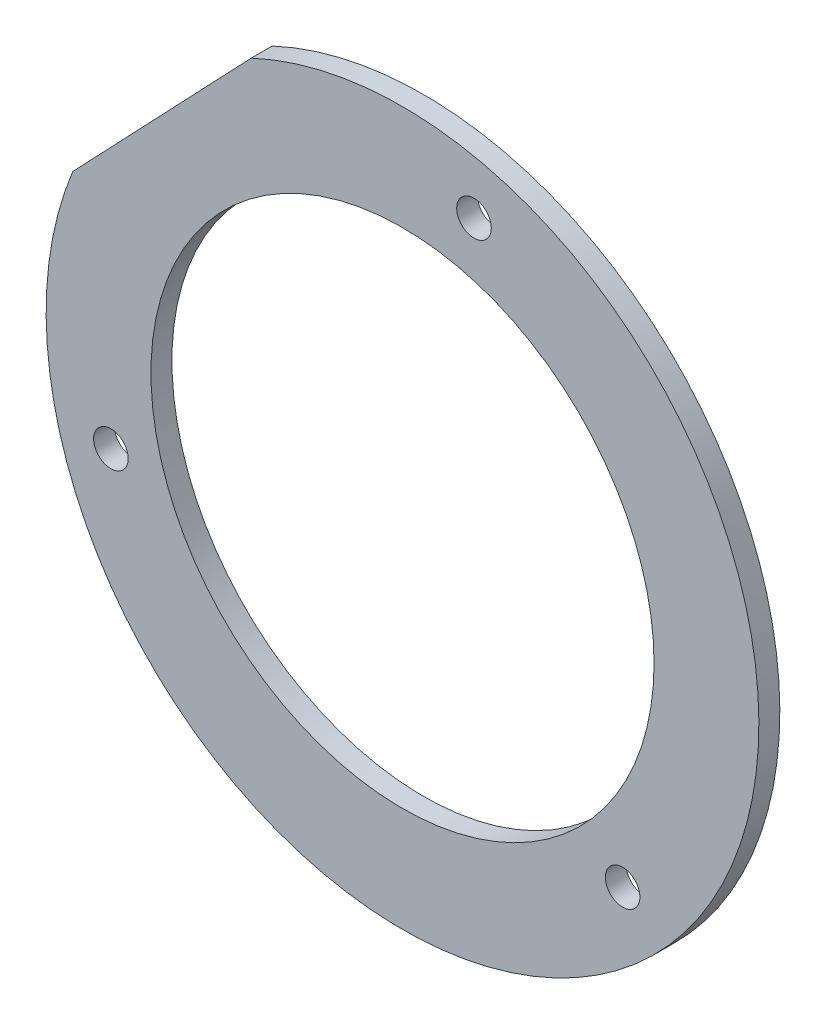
ISO-10303-21;
HEADER;
FILE_DESCRIPTION(('STEP AP214'),'2;1');
FILE_NAME('part.step','',(''),(''),'','','');
FILE_SCHEMA(('AUTOMOTIVE_DESIGN { 1 0 10303 214 1 1 1 1 }'));
ENDSEC;
DATA;
#1=APPLICATION_CONTEXT('core data for automotive mechanical design processes');
#2=APPLICATION_PROTOCOL_DEFINITION('international standard','automotive_design',2000,#1);
#3=PRODUCT_CONTEXT('',#1,'mechanical');
#4=PRODUCT('Part','Part','',(#3));
#5=PRODUCT_RELATED_PRODUCT_CATEGORY('part','',(#4));
#6=PRODUCT_DEFINITION_FORMATION('','',#4);
#7=PRODUCT_DEFINITION_CONTEXT('part definition',#1,'design');
#8=PRODUCT_DEFINITION('design','',#6,#7);
#9=PRODUCT_DEFINITION_SHAPE('','',#8);
#10=(LENGTH_UNIT() NAMED_UNIT(*) SI_UNIT(.MILLI.,.METRE.));
#11=(NAMED_UNIT(*) PLANE_ANGLE_UNIT() SI_UNIT($,.RADIAN.));
#12=(NAMED_UNIT(*) SI_UNIT($,.STERADIAN.) SOLID_ANGLE_UNIT());
#13=UNCERTAINTY_MEASURE_WITH_UNIT(LENGTH_MEASURE(1.E-05),#10,'distance_accuracy_value','');
#14=(GEOMETRIC_REPRESENTATION_CONTEXT(3) GLOBAL_UNCERTAINTY_ASSIGNED_CONTEXT((#13)) GLOBAL_UNIT_ASSIGNED_CONTEXT((#10,
#11,#12)) REPRESENTATION_CONTEXT('',''));
#15=CARTESIAN_POINT('',(0.,0.,0.));
#16=DIRECTION('',(0.,0.,1.));
#17=DIRECTION('',(1.,0.,0.));
#18=AXIS2_PLACEMENT_3D('',#15,#16,#17);
#19=CARTESIAN_POINT('',(17.,52.,2.));
#20=DIRECTION('',(0.,0.,1.));
#21=DIRECTION('',(1.,0.,0.));
#22=AXIS2_PLACEMENT_3D('',#19,#20,#21);
#23=PLANE('',#22);
#24=CARTESIAN_POINT('',(23.820508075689,80.1865334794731,2.));
#25=DIRECTION('',(0.,0.,1.));
#26=DIRECTION('',(1.,0.,0.));
#27=AXIS2_PLACEMENT_3D('',#24,#25,#26);
#28=CIRCLE('',#27,1.64999999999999);
#29=CARTESIAN_POINT('',(25.470508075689,80.1865334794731,2.));
#30=VERTEX_POINT('',#29);
#31=EDGE_CURVE('E93',#30,#30,#28,.T.);
#32=ORIENTED_EDGE('',*,*,#31,.F.);
#33=EDGE_LOOP('',(#32));
#34=FACE_BOUND('',#33,.T.);
#35=CARTESIAN_POINT('',(-10.8205080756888,43.8134665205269,2.));
#36=DIRECTION('',(0.,0.,1.));
#37=DIRECTION('',(1.,0.,0.));
#38=AXIS2_PLACEMENT_3D('',#35,#36,#37);
#39=CIRCLE('',#38,1.64999999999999);
#40=CARTESIAN_POINT('',(-9.17050807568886,43.8134665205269,2.));
#41=VERTEX_POINT('',#40);
#42=EDGE_CURVE('E87',#41,#41,#39,.T.);
#43=ORIENTED_EDGE('',*,*,#42,.F.);
#44=EDGE_LOOP('',(#43));
#45=FACE_BOUND('',#44,.T.);
#46=CARTESIAN_POINT('',(38.,32.,2.));
#47=DIRECTION('',(0.,0.,1.));
#48=DIRECTION('',(1.,0.,0.));
#49=AXIS2_PLACEMENT_3D('',#46,#47,#48);
#50=CIRCLE('',#49,1.64999999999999);
#51=CARTESIAN_POINT('',(39.65,32.,2.));
#52=VERTEX_POINT('',#51);
#53=EDGE_CURVE('E81',#52,#52,#50,.T.);
#54=ORIENTED_EDGE('',*,*,#53,.F.);
#55=EDGE_LOOP('',(#54));
#56=FACE_BOUND('',#55,.T.);
#57=CARTESIAN_POINT('',(17.,52.,2.));
#58=DIRECTION('',(0.,0.,1.));
#59=DIRECTION('',(1.,0.,0.));
#60=AXIS2_PLACEMENT_3D('',#57,#58,#59);
#61=CIRCLE('',#60,34.);
#62=CARTESIAN_POINT('',(-14.4528021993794,64.9120576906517,2.));
#63=VERTEX_POINT('',#62);
#64=CARTESIAN_POINT('',(2.56992467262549,82.7859209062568,2.));
#65=VERTEX_POINT('',#64);
#66=EDGE_CURVE('E62',#63,#65,#61,.T.);
#67=ORIENTED_EDGE('',*,*,#66,.T.);
#68=DIRECTION('',(-0.689655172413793,-0.724137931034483,0.));
#69=VECTOR('',#68,1.);
#70=CARTESIAN_POINT('',(2.56992467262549,82.7859209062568,2.));
#71=LINE('',#70,#69);
#72=EDGE_CURVE('E47',#65,#63,#71,.T.);
#73=ORIENTED_EDGE('',*,*,#72,.T.);
#74=EDGE_LOOP('',(#67,#73));
#75=FACE_BOUND('',#74,.T.);
#76=CARTESIAN_POINT('',(17.,52.,2.));
#77=DIRECTION('',(0.,0.,1.));
#78=DIRECTION('',(1.,0.,0.));
#79=AXIS2_PLACEMENT_3D('',#76,#77,#78);
#80=CIRCLE('',#79,24.);
#81=CARTESIAN_POINT('',(41.,52.,2.));
#82=VERTEX_POINT('',#81);
#83=EDGE_CURVE('E68',#82,#82,#80,.T.);
#84=ORIENTED_EDGE('',*,*,#83,.F.);
#85=EDGE_LOOP('',(#84));
#86=FACE_BOUND('',#85,.T.);
#87=ADVANCED_FACE('F31',(#34,#45,#56,#75,#86),#23,.T.);
#88=CARTESIAN_POINT('',(17.,52.,0.));
#89=DIRECTION('',(0.,0.,1.));
#90=DIRECTION('',(1.,0.,0.));
#91=AXIS2_PLACEMENT_3D('',#88,#89,#90);
#92=PLANE('',#91);
#93=CARTESIAN_POINT('',(23.820508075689,80.1865334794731,0.));
#94=DIRECTION('',(0.,0.,1.));
#95=DIRECTION('',(1.,0.,0.));
#96=AXIS2_PLACEMENT_3D('',#93,#94,#95);
#97=CIRCLE('',#96,1.65);
#98=CARTESIAN_POINT('',(25.470508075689,80.1865334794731,0.));
#99=VERTEX_POINT('',#98);
#100=EDGE_CURVE('E90',#99,#99,#97,.T.);
#101=ORIENTED_EDGE('',*,*,#100,.T.);
#102=EDGE_LOOP('',(#101));
#103=FACE_BOUND('',#102,.T.);
#104=CARTESIAN_POINT('',(-10.8205080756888,43.8134665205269,0.));
#105=DIRECTION('',(0.,0.,1.));
#106=DIRECTION('',(1.,0.,0.));
#107=AXIS2_PLACEMENT_3D('',#104,#105,#106);
#108=CIRCLE('',#107,1.65);
#109=CARTESIAN_POINT('',(-9.17050807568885,43.8134665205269,0.));
#110=VERTEX_POINT('',#109);
#111=EDGE_CURVE('E84',#110,#110,#108,.T.);
#112=ORIENTED_EDGE('',*,*,#111,.T.);
#113=EDGE_LOOP('',(#112));
#114=FACE_BOUND('',#113,.T.);
#115=CARTESIAN_POINT('',(38.,32.,0.));
#116=DIRECTION('',(0.,0.,1.));
#117=DIRECTION('',(1.,0.,0.));
#118=AXIS2_PLACEMENT_3D('',#115,#116,#117);
#119=CIRCLE('',#118,1.65);
#120=CARTESIAN_POINT('',(39.65,32.,0.));
#121=VERTEX_POINT('',#120);
#122=EDGE_CURVE('E77',#121,#121,#119,.T.);
#123=ORIENTED_EDGE('',*,*,#122,.T.);
#124=EDGE_LOOP('',(#123));
#125=FACE_BOUND('',#124,.T.);
#126=CARTESIAN_POINT('',(17.,52.,0.));
#127=DIRECTION('',(0.,0.,1.));
#128=DIRECTION('',(1.,0.,0.));
#129=AXIS2_PLACEMENT_3D('',#126,#127,#128);
#130=CIRCLE('',#129,34.);
#131=CARTESIAN_POINT('',(-14.4528021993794,64.9120576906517,0.));
#132=VERTEX_POINT('',#131);
#133=CARTESIAN_POINT('',(2.56992467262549,82.7859209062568,0.));
#134=VERTEX_POINT('',#133);
#135=EDGE_CURVE('E63',#132,#134,#130,.T.);
#136=ORIENTED_EDGE('',*,*,#135,.F.);
#137=DIRECTION('',(-0.689655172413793,-0.724137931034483,0.));
#138=VECTOR('',#137,1.);
#139=CARTESIAN_POINT('',(2.56992467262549,82.7859209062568,0.));
#140=LINE('',#139,#138);
#141=EDGE_CURVE('E55',#134,#132,#140,.T.);
#142=ORIENTED_EDGE('',*,*,#141,.F.);
#143=EDGE_LOOP('',(#136,#142));
#144=FACE_BOUND('',#143,.T.);
#145=CARTESIAN_POINT('',(17.,52.,0.));
#146=DIRECTION('',(0.,0.,1.));
#147=DIRECTION('',(1.,0.,0.));
#148=AXIS2_PLACEMENT_3D('',#145,#146,#147);
#149=CIRCLE('',#148,24.);
#150=CARTESIAN_POINT('',(41.,52.,0.));
#151=VERTEX_POINT('',#150);
#152=EDGE_CURVE('E71',#151,#151,#149,.T.);
#153=ORIENTED_EDGE('',*,*,#152,.T.);
#154=EDGE_LOOP('',(#153));
#155=FACE_BOUND('',#154,.T.);
#156=ADVANCED_FACE('F66',(#103,#114,#125,#144,#155),#92,.F.);
#157=CARTESIAN_POINT('',(17.,52.,2.));
#158=DIRECTION('',(0.,0.,-1.));
#159=DIRECTION('',(-1.,0.,0.));
#160=AXIS2_PLACEMENT_3D('',#157,#158,#159);
#161=CYLINDRICAL_SURFACE('',#160,34.);
#162=ORIENTED_EDGE('',*,*,#135,.T.);
#163=DIRECTION('',(0.,0.,-1.));
#164=VECTOR('',#163,1.);
#165=CARTESIAN_POINT('',(2.56992467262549,82.7859209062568,2.));
#166=LINE('',#165,#164);
#167=EDGE_CURVE('E11',#65,#134,#166,.T.);
#168=ORIENTED_EDGE('',*,*,#167,.F.);
#169=ORIENTED_EDGE('',*,*,#66,.F.);
#170=DIRECTION('',(0.,0.,-1.));
#171=VECTOR('',#170,1.);
#172=CARTESIAN_POINT('',(-14.4528021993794,64.9120576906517,2.));
#173=LINE('',#172,#171);
#174=EDGE_CURVE('E40',#63,#132,#173,.T.);
#175=ORIENTED_EDGE('',*,*,#174,.T.);
#176=EDGE_LOOP('',(#162,#168,#169,#175));
#177=FACE_BOUND('',#176,.T.);
#178=ADVANCED_FACE('F33',(#177),#161,.T.);
#179=CARTESIAN_POINT('',(2.56992467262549,82.7859209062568,2.));
#180=DIRECTION('',(0.724137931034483,-0.689655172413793,0.));
#181=DIRECTION('',(0.689655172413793,0.724137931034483,0.));
#182=AXIS2_PLACEMENT_3D('',#179,#180,#181);
#183=PLANE('',#182);
#184=ORIENTED_EDGE('',*,*,#141,.T.);
#185=ORIENTED_EDGE('',*,*,#174,.F.);
#186=ORIENTED_EDGE('',*,*,#72,.F.);
#187=ORIENTED_EDGE('',*,*,#167,.T.);
#188=EDGE_LOOP('',(#184,#185,#186,#187));
#189=FACE_BOUND('',#188,.T.);
#190=ADVANCED_FACE('F58',(#189),#183,.F.);
#191=CARTESIAN_POINT('',(17.,52.,2.));
#192=DIRECTION('',(0.,0.,-1.));
#193=DIRECTION('',(-1.,0.,0.));
#194=AXIS2_PLACEMENT_3D('',#191,#192,#193);
#195=CYLINDRICAL_SURFACE('',#194,24.);
#196=ORIENTED_EDGE('',*,*,#83,.T.);
#197=EDGE_LOOP('',(#196));
#198=FACE_BOUND('',#197,.T.);
#199=ORIENTED_EDGE('',*,*,#152,.F.);
#200=EDGE_LOOP('',(#199));
#201=FACE_BOUND('',#200,.T.);
#202=ADVANCED_FACE('F108',(#198,#201),#195,.F.);
#203=CARTESIAN_POINT('',(38.,32.,2.));
#204=DIRECTION('',(0.,0.,1.));
#205=DIRECTION('',(1.,0.,0.));
#206=AXIS2_PLACEMENT_3D('',#203,#204,#205);
#207=CYLINDRICAL_SURFACE('',#206,1.65);
#208=ORIENTED_EDGE('',*,*,#122,.F.);
#209=EDGE_LOOP('',(#208));
#210=FACE_BOUND('',#209,.T.);
#211=ORIENTED_EDGE('',*,*,#53,.T.);
#212=EDGE_LOOP('',(#211));
#213=FACE_BOUND('',#212,.T.);
#214=ADVANCED_FACE('F111',(#210,#213),#207,.F.);
#215=CARTESIAN_POINT('',(-10.8205080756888,43.8134665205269,2.));
#216=DIRECTION('',(0.,0.,1.));
#217=DIRECTION('',(1.,0.,0.));
#218=AXIS2_PLACEMENT_3D('',#215,#216,#217);
#219=CYLINDRICAL_SURFACE('',#218,1.64999999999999);
#220=ORIENTED_EDGE('',*,*,#111,.F.);
#221=EDGE_LOOP('',(#220));
#222=FACE_BOUND('',#221,.T.);
#223=ORIENTED_EDGE('',*,*,#42,.T.);
#224=EDGE_LOOP('',(#223));
#225=FACE_BOUND('',#224,.T.);
#226=ADVANCED_FACE('F137',(#222,#225),#219,.F.);
#227=CARTESIAN_POINT('',(23.820508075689,80.1865334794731,2.));
#228=DIRECTION('',(0.,0.,1.));
#229=DIRECTION('',(1.,0.,0.));
#230=AXIS2_PLACEMENT_3D('',#227,#228,#229);
#231=CYLINDRICAL_SURFACE('',#230,1.64999999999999);
#232=ORIENTED_EDGE('',*,*,#100,.F.);
#233=EDGE_LOOP('',(#232));
#234=FACE_BOUND('',#233,.T.);
#235=ORIENTED_EDGE('',*,*,#31,.T.);
#236=EDGE_LOOP('',(#235));
#237=FACE_BOUND('',#236,.T.);
#238=ADVANCED_FACE('F97',(#234,#237),#231,.F.);
#239=CLOSED_SHELL('',(#87,#156,#178,#190,#202,#214,#226,#238));
#240=MANIFOLD_SOLID_BREP('B2',#239);
#241=ADVANCED_BREP_SHAPE_REPRESENTATION('',(#18,#240),#14);
#242=SHAPE_DEFINITION_REPRESENTATION(#9,#241);
ENDSEC;
END-ISO-10303-21;
